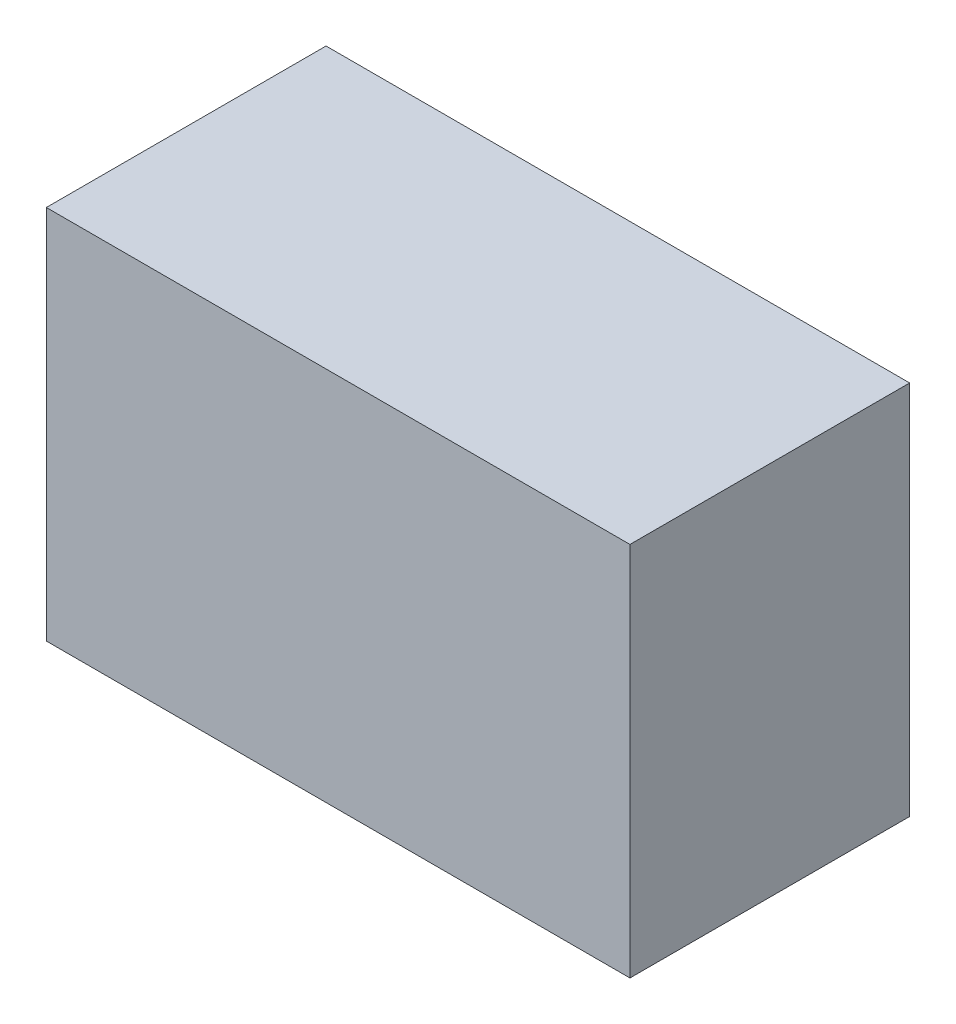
from build123d import *

# Parameters (mm, degrees)
GENERAL_W           = 5.299999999
GENERAL_H           = 3.41
BOSS_EXTRUDE1_DEPTH = 2.54


with BuildPart() as part:
    # GENERAL → Boss-Extrude1 (new body)
    with BuildSketch(Plane.XY):
        with Locations((-0.1, -0.004999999)):
            Rectangle(GENERAL_W, GENERAL_H)
    extrude(amount=BOSS_EXTRUDE1_DEPTH)


solid = part.part
